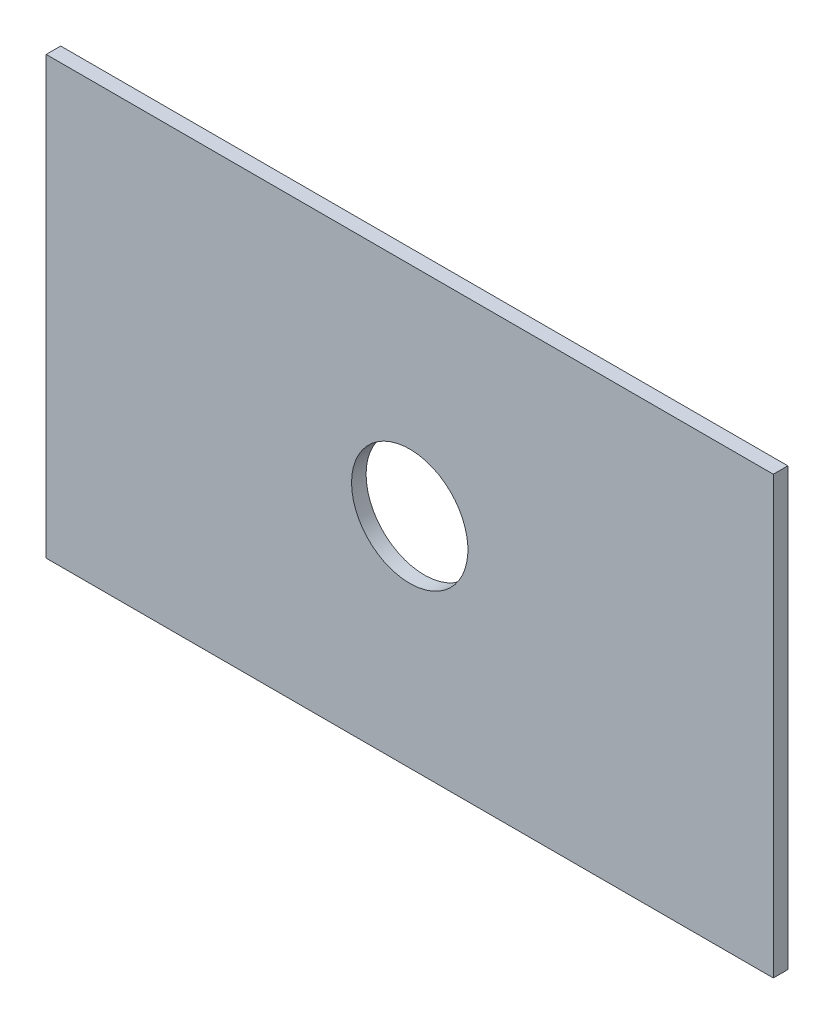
ISO-10303-21;
HEADER;
FILE_DESCRIPTION(('STEP AP214'),'2;1');
FILE_NAME('part.step','',(''),(''),'','','');
FILE_SCHEMA(('AUTOMOTIVE_DESIGN { 1 0 10303 214 1 1 1 1 }'));
ENDSEC;
DATA;
#1=APPLICATION_CONTEXT('core data for automotive mechanical design processes');
#2=APPLICATION_PROTOCOL_DEFINITION('international standard','automotive_design',2000,#1);
#3=PRODUCT_CONTEXT('',#1,'mechanical');
#4=PRODUCT('Part','Part','',(#3));
#5=PRODUCT_RELATED_PRODUCT_CATEGORY('part','',(#4));
#6=PRODUCT_DEFINITION_FORMATION('','',#4);
#7=PRODUCT_DEFINITION_CONTEXT('part definition',#1,'design');
#8=PRODUCT_DEFINITION('design','',#6,#7);
#9=PRODUCT_DEFINITION_SHAPE('','',#8);
#10=(LENGTH_UNIT() NAMED_UNIT(*) SI_UNIT(.MILLI.,.METRE.));
#11=(NAMED_UNIT(*) PLANE_ANGLE_UNIT() SI_UNIT($,.RADIAN.));
#12=(NAMED_UNIT(*) SI_UNIT($,.STERADIAN.) SOLID_ANGLE_UNIT());
#13=UNCERTAINTY_MEASURE_WITH_UNIT(LENGTH_MEASURE(1.E-05),#10,'distance_accuracy_value','');
#14=(GEOMETRIC_REPRESENTATION_CONTEXT(3) GLOBAL_UNCERTAINTY_ASSIGNED_CONTEXT((#13)) GLOBAL_UNIT_ASSIGNED_CONTEXT((#10,
#11,#12)) REPRESENTATION_CONTEXT('',''));
#15=CARTESIAN_POINT('',(0.,0.,0.));
#16=DIRECTION('',(0.,0.,1.));
#17=DIRECTION('',(1.,0.,0.));
#18=AXIS2_PLACEMENT_3D('',#15,#16,#17);
#19=CARTESIAN_POINT('',(0.,0.,1.00000000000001));
#20=DIRECTION('',(0.,0.,-1.));
#21=DIRECTION('',(-1.,0.,0.));
#22=AXIS2_PLACEMENT_3D('',#19,#20,#21);
#23=PLANE('',#22);
#24=DIRECTION('',(0.,1.,0.));
#25=VECTOR('',#24,1.);
#26=CARTESIAN_POINT('',(25.0000000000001,-15.,1.00000000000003));
#27=LINE('',#26,#25);
#28=CARTESIAN_POINT('',(25.0000000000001,-15.,1.00000000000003));
#29=VERTEX_POINT('',#28);
#30=CARTESIAN_POINT('',(24.9999999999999,15.,1.00000000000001));
#31=VERTEX_POINT('',#30);
#32=EDGE_CURVE('E83',#29,#31,#27,.T.);
#33=ORIENTED_EDGE('',*,*,#32,.T.);
#34=DIRECTION('',(-1.,0.,0.));
#35=VECTOR('',#34,1.);
#36=CARTESIAN_POINT('',(-24.9999999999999,15.,1.));
#37=LINE('',#36,#35);
#38=CARTESIAN_POINT('',(-24.9999999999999,15.,1.));
#39=VERTEX_POINT('',#38);
#40=EDGE_CURVE('E78',#31,#39,#37,.T.);
#41=ORIENTED_EDGE('',*,*,#40,.T.);
#42=DIRECTION('',(0.,-1.,0.));
#43=VECTOR('',#42,1.);
#44=CARTESIAN_POINT('',(-24.9999999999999,-15.0000000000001,1.00000000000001));
#45=LINE('',#44,#43);
#46=CARTESIAN_POINT('',(-24.9999999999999,-15.0000000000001,1.00000000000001));
#47=VERTEX_POINT('',#46);
#48=EDGE_CURVE('E81',#39,#47,#45,.T.);
#49=ORIENTED_EDGE('',*,*,#48,.T.);
#50=DIRECTION('',(1.,0.,0.));
#51=VECTOR('',#50,1.);
#52=CARTESIAN_POINT('',(-24.9999999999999,-15.0000000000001,1.00000000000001));
#53=LINE('',#52,#51);
#54=EDGE_CURVE('E48',#47,#29,#53,.T.);
#55=ORIENTED_EDGE('',*,*,#54,.T.);
#56=EDGE_LOOP('',(#33,#41,#49,#55));
#57=FACE_BOUND('',#56,.T.);
#58=CARTESIAN_POINT('',(0.,0.,1.00000000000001));
#59=DIRECTION('',(0.,0.,1.));
#60=DIRECTION('',(1.,0.,0.));
#61=AXIS2_PLACEMENT_3D('',#58,#59,#60);
#62=CIRCLE('',#61,4.);
#63=CARTESIAN_POINT('',(-4.,0.,1.00000000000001));
#64=VERTEX_POINT('',#63);
#65=EDGE_CURVE('E98',#64,#64,#62,.T.);
#66=ORIENTED_EDGE('',*,*,#65,.F.);
#67=EDGE_LOOP('',(#66));
#68=FACE_BOUND('',#67,.T.);
#69=ADVANCED_FACE('F31',(#57,#68),#23,.F.);
#70=CARTESIAN_POINT('',(0.,0.,0.));
#71=DIRECTION('',(0.,0.,-1.));
#72=DIRECTION('',(-1.,0.,0.));
#73=AXIS2_PLACEMENT_3D('',#70,#71,#72);
#74=PLANE('',#73);
#75=DIRECTION('',(0.,1.,0.));
#76=VECTOR('',#75,1.);
#77=CARTESIAN_POINT('',(25.0000000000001,-15.,0.));
#78=LINE('',#77,#76);
#79=CARTESIAN_POINT('',(25.0000000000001,-15.,0.));
#80=VERTEX_POINT('',#79);
#81=CARTESIAN_POINT('',(25.0000000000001,15.,0.));
#82=VERTEX_POINT('',#81);
#83=EDGE_CURVE('E95',#80,#82,#78,.T.);
#84=ORIENTED_EDGE('',*,*,#83,.F.);
#85=DIRECTION('',(1.,0.,0.));
#86=VECTOR('',#85,1.);
#87=CARTESIAN_POINT('',(-24.9999999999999,-15.,0.));
#88=LINE('',#87,#86);
#89=CARTESIAN_POINT('',(-24.9999999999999,-15.,0.));
#90=VERTEX_POINT('',#89);
#91=EDGE_CURVE('E71',#90,#80,#88,.T.);
#92=ORIENTED_EDGE('',*,*,#91,.F.);
#93=DIRECTION('',(0.,-1.,0.));
#94=VECTOR('',#93,1.);
#95=CARTESIAN_POINT('',(-24.9999999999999,-15.,0.));
#96=LINE('',#95,#94);
#97=CARTESIAN_POINT('',(-24.9999999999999,15.,0.));
#98=VERTEX_POINT('',#97);
#99=EDGE_CURVE('E65',#98,#90,#96,.T.);
#100=ORIENTED_EDGE('',*,*,#99,.F.);
#101=DIRECTION('',(-1.,0.,0.));
#102=VECTOR('',#101,1.);
#103=CARTESIAN_POINT('',(-24.9999999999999,15.,0.));
#104=LINE('',#103,#102);
#105=EDGE_CURVE('E87',#82,#98,#104,.T.);
#106=ORIENTED_EDGE('',*,*,#105,.F.);
#107=EDGE_LOOP('',(#84,#92,#100,#106));
#108=FACE_BOUND('',#107,.T.);
#109=CARTESIAN_POINT('',(0.,0.,0.));
#110=DIRECTION('',(0.,0.,1.));
#111=DIRECTION('',(1.,0.,0.));
#112=AXIS2_PLACEMENT_3D('',#109,#110,#111);
#113=CIRCLE('',#112,4.);
#114=CARTESIAN_POINT('',(-4.,0.,0.));
#115=VERTEX_POINT('',#114);
#116=EDGE_CURVE('E110',#115,#115,#113,.T.);
#117=ORIENTED_EDGE('',*,*,#116,.T.);
#118=EDGE_LOOP('',(#117));
#119=FACE_BOUND('',#118,.T.);
#120=ADVANCED_FACE('F106',(#108,#119),#74,.T.);
#121=CARTESIAN_POINT('',(25.0000000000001,-15.,1.00000000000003));
#122=DIRECTION('',(-1.,0.,0.));
#123=DIRECTION('',(0.,0.,1.));
#124=AXIS2_PLACEMENT_3D('',#121,#122,#123);
#125=PLANE('',#124);
#126=ORIENTED_EDGE('',*,*,#83,.T.);
#127=DIRECTION('',(0.,0.,-1.));
#128=VECTOR('',#127,1.);
#129=CARTESIAN_POINT('',(24.9999999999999,15.,1.00000000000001));
#130=LINE('',#129,#128);
#131=EDGE_CURVE('E11',#31,#82,#130,.T.);
#132=ORIENTED_EDGE('',*,*,#131,.F.);
#133=ORIENTED_EDGE('',*,*,#32,.F.);
#134=DIRECTION('',(0.,0.,-1.));
#135=VECTOR('',#134,1.);
#136=CARTESIAN_POINT('',(25.0000000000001,-15.,1.00000000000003));
#137=LINE('',#136,#135);
#138=EDGE_CURVE('E91',#29,#80,#137,.T.);
#139=ORIENTED_EDGE('',*,*,#138,.T.);
#140=EDGE_LOOP('',(#126,#132,#133,#139));
#141=FACE_BOUND('',#140,.T.);
#142=ADVANCED_FACE('F33',(#141),#125,.F.);
#143=CARTESIAN_POINT('',(-24.9999999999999,15.,1.));
#144=DIRECTION('',(0.,-1.,0.));
#145=DIRECTION('',(0.,0.,-1.));
#146=AXIS2_PLACEMENT_3D('',#143,#144,#145);
#147=PLANE('',#146);
#148=ORIENTED_EDGE('',*,*,#105,.T.);
#149=DIRECTION('',(0.,0.,-1.));
#150=VECTOR('',#149,1.);
#151=CARTESIAN_POINT('',(-24.9999999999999,15.,1.));
#152=LINE('',#151,#150);
#153=EDGE_CURVE('E40',#39,#98,#152,.T.);
#154=ORIENTED_EDGE('',*,*,#153,.F.);
#155=ORIENTED_EDGE('',*,*,#40,.F.);
#156=ORIENTED_EDGE('',*,*,#131,.T.);
#157=EDGE_LOOP('',(#148,#154,#155,#156));
#158=FACE_BOUND('',#157,.T.);
#159=ADVANCED_FACE('F86',(#158),#147,.F.);
#160=CARTESIAN_POINT('',(-24.9999999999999,-15.0000000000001,1.00000000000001));
#161=DIRECTION('',(1.,0.,0.));
#162=DIRECTION('',(0.,0.,-1.));
#163=AXIS2_PLACEMENT_3D('',#160,#161,#162);
#164=PLANE('',#163);
#165=ORIENTED_EDGE('',*,*,#99,.T.);
#166=DIRECTION('',(0.,0.,-1.));
#167=VECTOR('',#166,1.);
#168=CARTESIAN_POINT('',(-24.9999999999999,-15.0000000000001,1.00000000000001));
#169=LINE('',#168,#167);
#170=EDGE_CURVE('E88',#47,#90,#169,.T.);
#171=ORIENTED_EDGE('',*,*,#170,.F.);
#172=ORIENTED_EDGE('',*,*,#48,.F.);
#173=ORIENTED_EDGE('',*,*,#153,.T.);
#174=EDGE_LOOP('',(#165,#171,#172,#173));
#175=FACE_BOUND('',#174,.T.);
#176=ADVANCED_FACE('F89',(#175),#164,.F.);
#177=CARTESIAN_POINT('',(-24.9999999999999,-15.0000000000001,1.00000000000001));
#178=DIRECTION('',(0.,1.,0.));
#179=DIRECTION('',(0.,0.,1.));
#180=AXIS2_PLACEMENT_3D('',#177,#178,#179);
#181=PLANE('',#180);
#182=ORIENTED_EDGE('',*,*,#91,.T.);
#183=ORIENTED_EDGE('',*,*,#138,.F.);
#184=ORIENTED_EDGE('',*,*,#54,.F.);
#185=ORIENTED_EDGE('',*,*,#170,.T.);
#186=EDGE_LOOP('',(#182,#183,#184,#185));
#187=FACE_BOUND('',#186,.T.);
#188=ADVANCED_FACE('F103',(#187),#181,.F.);
#189=CARTESIAN_POINT('',(0.,0.,1.00000000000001));
#190=DIRECTION('',(0.,0.,-1.));
#191=DIRECTION('',(-1.,0.,0.));
#192=AXIS2_PLACEMENT_3D('',#189,#190,#191);
#193=CYLINDRICAL_SURFACE('',#192,4.);
#194=CARTESIAN_POINT('',(-4.,0.,1.00000000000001));
#195=CARTESIAN_POINT('',(-4.,0.,0.989583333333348));
#196=CARTESIAN_POINT('',(-4.,0.,0.979166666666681));
#197=CARTESIAN_POINT('',(-4.,0.,0.958333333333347));
#198=CARTESIAN_POINT('',(-4.,0.,0.947916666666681));
#199=CARTESIAN_POINT('',(-4.,0.,0.927083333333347));
#200=CARTESIAN_POINT('',(-4.,0.,0.91666666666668));
#201=CARTESIAN_POINT('',(-4.,0.,0.895833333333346));
#202=CARTESIAN_POINT('',(-4.,0.,0.88541666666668));
#203=CARTESIAN_POINT('',(-4.,0.,0.864583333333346));
#204=CARTESIAN_POINT('',(-4.,0.,0.854166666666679));
#205=CARTESIAN_POINT('',(-4.,0.,0.833333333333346));
#206=CARTESIAN_POINT('',(-4.,0.,0.822916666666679));
#207=CARTESIAN_POINT('',(-4.,0.,0.802083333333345));
#208=CARTESIAN_POINT('',(-4.,0.,0.791666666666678));
#209=CARTESIAN_POINT('',(-4.,0.,0.770833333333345));
#210=CARTESIAN_POINT('',(-4.,0.,0.760416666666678));
#211=CARTESIAN_POINT('',(-4.,0.,0.739583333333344));
#212=CARTESIAN_POINT('',(-4.,0.,0.729166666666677));
#213=CARTESIAN_POINT('',(-4.,0.,0.708333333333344));
#214=CARTESIAN_POINT('',(-4.,0.,0.697916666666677));
#215=CARTESIAN_POINT('',(-4.,0.,0.677083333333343));
#216=CARTESIAN_POINT('',(-4.,0.,0.666666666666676));
#217=CARTESIAN_POINT('',(-4.,0.,0.645833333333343));
#218=CARTESIAN_POINT('',(-4.,0.,0.635416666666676));
#219=CARTESIAN_POINT('',(-4.,0.,0.614583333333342));
#220=CARTESIAN_POINT('',(-4.,0.,0.604166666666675));
#221=CARTESIAN_POINT('',(-4.,0.,0.583333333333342));
#222=CARTESIAN_POINT('',(-4.,0.,0.572916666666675));
#223=CARTESIAN_POINT('',(-4.,0.,0.552083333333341));
#224=CARTESIAN_POINT('',(-4.,0.,0.541666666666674));
#225=CARTESIAN_POINT('',(-4.,0.,0.520833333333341));
#226=CARTESIAN_POINT('',(-4.,0.,0.510416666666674));
#227=CARTESIAN_POINT('',(-4.,0.,0.48958333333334));
#228=CARTESIAN_POINT('',(-4.,0.,0.479166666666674));
#229=CARTESIAN_POINT('',(-4.,0.,0.45833333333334));
#230=CARTESIAN_POINT('',(-4.,0.,0.447916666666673));
#231=CARTESIAN_POINT('',(-4.,0.,0.42708333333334));
#232=CARTESIAN_POINT('',(-4.,0.,0.416666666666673));
#233=CARTESIAN_POINT('',(-4.,0.,0.395833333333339));
#234=CARTESIAN_POINT('',(-4.,0.,0.385416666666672));
#235=CARTESIAN_POINT('',(-4.,0.,0.364583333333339));
#236=CARTESIAN_POINT('',(-4.,0.,0.354166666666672));
#237=CARTESIAN_POINT('',(-4.,0.,0.333333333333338));
#238=CARTESIAN_POINT('',(-4.,0.,0.322916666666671));
#239=CARTESIAN_POINT('',(-4.,0.,0.302083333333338));
#240=CARTESIAN_POINT('',(-4.,0.,0.291666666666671));
#241=CARTESIAN_POINT('',(-4.,0.,0.270833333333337));
#242=CARTESIAN_POINT('',(-4.,0.,0.26041666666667));
#243=CARTESIAN_POINT('',(-4.,0.,0.239583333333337));
#244=CARTESIAN_POINT('',(-4.,0.,0.22916666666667));
#245=CARTESIAN_POINT('',(-4.,0.,0.208333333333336));
#246=CARTESIAN_POINT('',(-4.,0.,0.197916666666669));
#247=CARTESIAN_POINT('',(-4.,0.,0.177083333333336));
#248=CARTESIAN_POINT('',(-4.,0.,0.166666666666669));
#249=CARTESIAN_POINT('',(-4.,0.,0.145833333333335));
#250=CARTESIAN_POINT('',(-4.,0.,0.135416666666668));
#251=CARTESIAN_POINT('',(-4.,0.,0.114583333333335));
#252=CARTESIAN_POINT('',(-4.,0.,0.104166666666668));
#253=CARTESIAN_POINT('',(-4.,0.,0.0833333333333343));
#254=CARTESIAN_POINT('',(-4.,0.,0.0729166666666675));
#255=CARTESIAN_POINT('',(-4.,0.,0.0520833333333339));
#256=CARTESIAN_POINT('',(-4.,0.,0.0416666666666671));
#257=CARTESIAN_POINT('',(-4.,0.,0.0208333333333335));
#258=CARTESIAN_POINT('',(-4.,0.,0.0104166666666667));
#259=CARTESIAN_POINT('',(-4.,0.,0.));
#260=B_SPLINE_CURVE_WITH_KNOTS('',3,(#194,#195,#196,#197,#198,#199,#200,#201,#202,#203,#204,
#205,#206,#207,#208,#209,#210,#211,#212,#213,#214,#215,#216,#217,#218,#219,#220,#221,#222,#223,
#224,#225,#226,#227,#228,#229,#230,#231,#232,#233,#234,#235,#236,#237,#238,#239,#240,#241,#242,
#243,#244,#245,#246,#247,#248,#249,#250,#251,#252,#253,#254,#255,#256,#257,#258,#259),
.UNSPECIFIED.,.F.,.F.,(4,2,2,2,2,2,2,2,2,2,2,2,2,2,2,2,2,2,2,2,2,2,2,2,2,2,2,2,2,2,2,2,4),(0.,
0.0312500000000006,0.062500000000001,0.0937500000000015,0.125000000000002,0.156250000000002,
0.187500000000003,0.218750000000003,0.250000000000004,0.281250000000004,0.312500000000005,
0.343750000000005,0.375000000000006,0.406250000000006,0.437500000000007,0.468750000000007,
0.500000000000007,0.531250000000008,0.562500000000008,0.593750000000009,0.625000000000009,
0.65625000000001,0.68750000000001,0.718750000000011,0.750000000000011,0.781250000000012,
0.812500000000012,0.843750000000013,0.875000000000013,0.906250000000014,0.937500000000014,
0.968750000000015,1.00000000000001),.UNSPECIFIED.);
#261=EDGE_CURVE('BSEAM116',#64,#115,#260,.T.);
#262=ORIENTED_EDGE('',*,*,#65,.T.);
#263=ORIENTED_EDGE('',*,*,#116,.F.);
#264=ORIENTED_EDGE('',*,*,#261,.T.);
#265=ORIENTED_EDGE('',*,*,#261,.F.);
#266=EDGE_LOOP('',(#262,#264,#263,#265));
#267=FACE_BOUND('',#266,.T.);
#268=ADVANCED_FACE('F116',(#267),#193,.F.);
#269=CLOSED_SHELL('',(#69,#120,#142,#159,#176,#188,#268));
#270=MANIFOLD_SOLID_BREP('B2',#269);
#271=ADVANCED_BREP_SHAPE_REPRESENTATION('',(#18,#270),#14);
#272=SHAPE_DEFINITION_REPRESENTATION(#9,#271);
ENDSEC;
END-ISO-10303-21;
